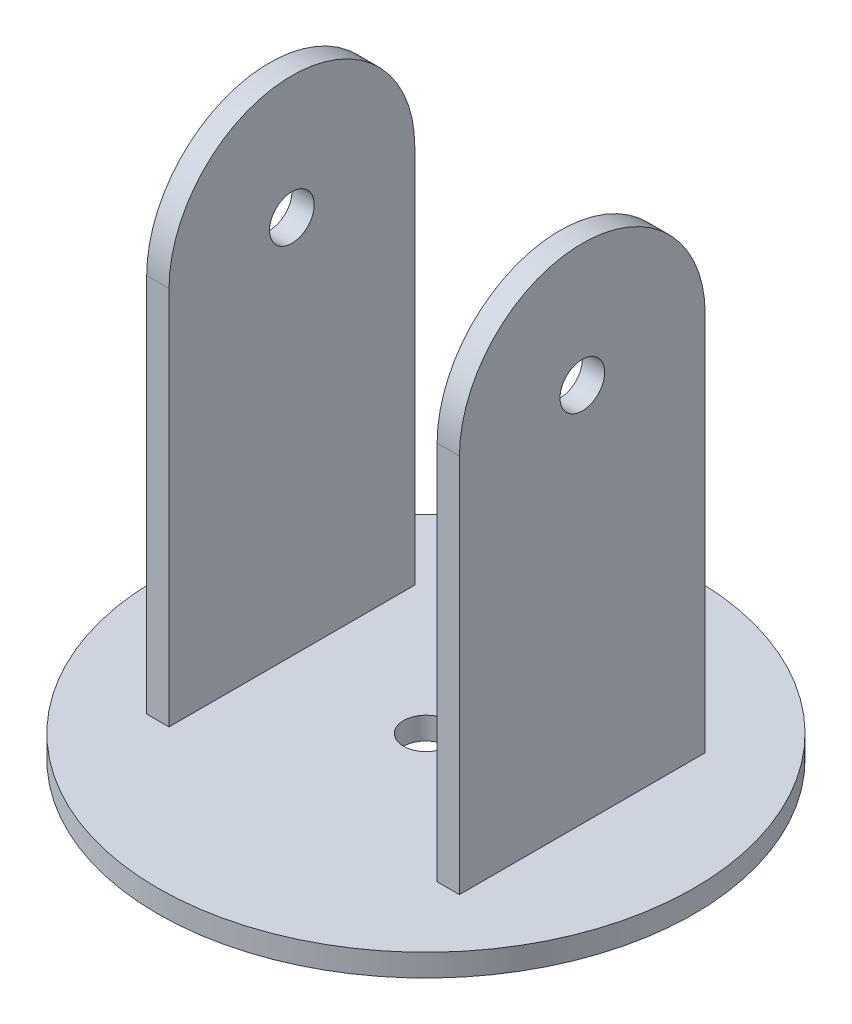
ISO-10303-21;
HEADER;
FILE_DESCRIPTION(('STEP AP214'),'2;1');
FILE_NAME('part.step','',(''),(''),'','','');
FILE_SCHEMA(('AUTOMOTIVE_DESIGN { 1 0 10303 214 1 1 1 1 }'));
ENDSEC;
DATA;
#1=APPLICATION_CONTEXT('core data for automotive mechanical design processes');
#2=APPLICATION_PROTOCOL_DEFINITION('international standard','automotive_design',2000,#1);
#3=PRODUCT_CONTEXT('',#1,'mechanical');
#4=PRODUCT('Part','Part','',(#3));
#5=PRODUCT_RELATED_PRODUCT_CATEGORY('part','',(#4));
#6=PRODUCT_DEFINITION_FORMATION('','',#4);
#7=PRODUCT_DEFINITION_CONTEXT('part definition',#1,'design');
#8=PRODUCT_DEFINITION('design','',#6,#7);
#9=PRODUCT_DEFINITION_SHAPE('','',#8);
#10=(LENGTH_UNIT() NAMED_UNIT(*) SI_UNIT(.MILLI.,.METRE.));
#11=(NAMED_UNIT(*) PLANE_ANGLE_UNIT() SI_UNIT($,.RADIAN.));
#12=(NAMED_UNIT(*) SI_UNIT($,.STERADIAN.) SOLID_ANGLE_UNIT());
#13=UNCERTAINTY_MEASURE_WITH_UNIT(LENGTH_MEASURE(1.E-05),#10,'distance_accuracy_value','');
#14=(GEOMETRIC_REPRESENTATION_CONTEXT(3) GLOBAL_UNCERTAINTY_ASSIGNED_CONTEXT((#13)) GLOBAL_UNIT_ASSIGNED_CONTEXT((#10,
#11,#12)) REPRESENTATION_CONTEXT('',''));
#15=CARTESIAN_POINT('',(0.,0.,0.));
#16=DIRECTION('',(0.,0.,1.));
#17=DIRECTION('',(1.,0.,0.));
#18=AXIS2_PLACEMENT_3D('',#15,#16,#17);
#19=CARTESIAN_POINT('',(0.,5.,0.));
#20=DIRECTION('',(0.,-1.,0.));
#21=DIRECTION('',(0.,0.,-1.));
#22=AXIS2_PLACEMENT_3D('',#19,#20,#21);
#23=CYLINDRICAL_SURFACE('',#22,60.);
#24=CARTESIAN_POINT('',(0.,5.,0.));
#25=DIRECTION('',(0.,1.,0.));
#26=DIRECTION('',(0.,0.,1.));
#27=AXIS2_PLACEMENT_3D('',#24,#25,#26);
#28=CIRCLE('',#27,60.);
#29=CARTESIAN_POINT('',(0.,5.,60.));
#30=VERTEX_POINT('',#29);
#31=EDGE_CURVE('E11',#30,#30,#28,.T.);
#32=ORIENTED_EDGE('',*,*,#31,.F.);
#33=EDGE_LOOP('',(#32));
#34=FACE_BOUND('',#33,.T.);
#35=CARTESIAN_POINT('',(0.,0.,0.));
#36=DIRECTION('',(0.,1.,0.));
#37=DIRECTION('',(0.,0.,1.));
#38=AXIS2_PLACEMENT_3D('',#35,#36,#37);
#39=CIRCLE('',#38,60.);
#40=CARTESIAN_POINT('',(0.,0.,60.));
#41=VERTEX_POINT('',#40);
#42=EDGE_CURVE('E48',#41,#41,#39,.T.);
#43=ORIENTED_EDGE('',*,*,#42,.T.);
#44=EDGE_LOOP('',(#43));
#45=FACE_BOUND('',#44,.T.);
#46=ADVANCED_FACE('F39',(#34,#45),#23,.T.);
#47=CARTESIAN_POINT('',(0.,5.,0.));
#48=DIRECTION('',(0.,1.,0.));
#49=DIRECTION('',(0.,0.,1.));
#50=AXIS2_PLACEMENT_3D('',#47,#48,#49);
#51=PLANE('',#50);
#52=CARTESIAN_POINT('',(0.,5.,0.));
#53=DIRECTION('',(0.,1.,0.));
#54=DIRECTION('',(0.,0.,1.));
#55=AXIS2_PLACEMENT_3D('',#52,#53,#54);
#56=CIRCLE('',#55,5.);
#57=CARTESIAN_POINT('',(0.,5.,5.));
#58=VERTEX_POINT('',#57);
#59=EDGE_CURVE('E384',#58,#58,#56,.T.);
#60=ORIENTED_EDGE('',*,*,#59,.F.);
#61=EDGE_LOOP('',(#60));
#62=FACE_BOUND('',#61,.T.);
#63=DIRECTION('',(0.,0.,-1.));
#64=VECTOR('',#63,1.);
#65=CARTESIAN_POINT('',(-30.,5.,0.));
#66=LINE('',#65,#64);
#67=CARTESIAN_POINT('',(-30.,5.,27.5));
#68=VERTEX_POINT('',#67);
#69=CARTESIAN_POINT('',(-30.,5.,-27.5));
#70=VERTEX_POINT('',#69);
#71=EDGE_CURVE('E115',#68,#70,#66,.T.);
#72=ORIENTED_EDGE('',*,*,#71,.F.);
#73=DIRECTION('',(-1.,0.,0.));
#74=VECTOR('',#73,1.);
#75=CARTESIAN_POINT('',(0.,5.,27.5));
#76=LINE('',#75,#74);
#77=CARTESIAN_POINT('',(-35.,5.,27.5));
#78=VERTEX_POINT('',#77);
#79=EDGE_CURVE('E159',#68,#78,#76,.T.);
#80=ORIENTED_EDGE('',*,*,#79,.T.);
#81=DIRECTION('',(0.,0.,-1.));
#82=VECTOR('',#81,1.);
#83=CARTESIAN_POINT('',(-35.,5.,0.));
#84=LINE('',#83,#82);
#85=CARTESIAN_POINT('',(-35.,5.,-27.5));
#86=VERTEX_POINT('',#85);
#87=EDGE_CURVE('E149',#78,#86,#84,.T.);
#88=ORIENTED_EDGE('',*,*,#87,.T.);
#89=DIRECTION('',(1.,0.,0.));
#90=VECTOR('',#89,1.);
#91=CARTESIAN_POINT('',(0.,5.,-27.5));
#92=LINE('',#91,#90);
#93=EDGE_CURVE('E156',#86,#70,#92,.T.);
#94=ORIENTED_EDGE('',*,*,#93,.T.);
#95=EDGE_LOOP('',(#72,#80,#88,#94));
#96=FACE_BOUND('',#95,.T.);
#97=DIRECTION('',(0.,0.,1.));
#98=VECTOR('',#97,1.);
#99=CARTESIAN_POINT('',(30.,5.,0.));
#100=LINE('',#99,#98);
#101=CARTESIAN_POINT('',(30.,5.,-27.5));
#102=VERTEX_POINT('',#101);
#103=CARTESIAN_POINT('',(30.,5.,27.5));
#104=VERTEX_POINT('',#103);
#105=EDGE_CURVE('E193',#102,#104,#100,.T.);
#106=ORIENTED_EDGE('',*,*,#105,.F.);
#107=DIRECTION('',(-1.,0.,0.));
#108=VECTOR('',#107,1.);
#109=CARTESIAN_POINT('',(0.,5.,-27.5));
#110=LINE('',#109,#108);
#111=CARTESIAN_POINT('',(35.,5.,-27.5));
#112=VERTEX_POINT('',#111);
#113=EDGE_CURVE('E199',#112,#102,#110,.T.);
#114=ORIENTED_EDGE('',*,*,#113,.F.);
#115=DIRECTION('',(0.,0.,1.));
#116=VECTOR('',#115,1.);
#117=CARTESIAN_POINT('',(35.,5.,0.));
#118=LINE('',#117,#116);
#119=CARTESIAN_POINT('',(35.,5.,27.5));
#120=VERTEX_POINT('',#119);
#121=EDGE_CURVE('E187',#112,#120,#118,.T.);
#122=ORIENTED_EDGE('',*,*,#121,.T.);
#123=DIRECTION('',(1.,0.,0.));
#124=VECTOR('',#123,1.);
#125=CARTESIAN_POINT('',(0.,5.,27.5));
#126=LINE('',#125,#124);
#127=EDGE_CURVE('E196',#104,#120,#126,.T.);
#128=ORIENTED_EDGE('',*,*,#127,.F.);
#129=EDGE_LOOP('',(#106,#114,#122,#128));
#130=FACE_BOUND('',#129,.T.);
#131=ORIENTED_EDGE('',*,*,#31,.T.);
#132=EDGE_LOOP('',(#131));
#133=FACE_BOUND('',#132,.T.);
#134=ADVANCED_FACE('F209',(#62,#96,#130,#133),#51,.T.);
#135=CARTESIAN_POINT('',(0.,0.,0.));
#136=DIRECTION('',(0.,1.,0.));
#137=DIRECTION('',(0.,0.,1.));
#138=AXIS2_PLACEMENT_3D('',#135,#136,#137);
#139=PLANE('',#138);
#140=CARTESIAN_POINT('',(0.,0.,0.));
#141=DIRECTION('',(0.,1.,0.));
#142=DIRECTION('',(0.,0.,1.));
#143=AXIS2_PLACEMENT_3D('',#140,#141,#142);
#144=CIRCLE('',#143,5.);
#145=CARTESIAN_POINT('',(0.,0.,5.));
#146=VERTEX_POINT('',#145);
#147=EDGE_CURVE('E383',#146,#146,#144,.T.);
#148=ORIENTED_EDGE('',*,*,#147,.T.);
#149=EDGE_LOOP('',(#148));
#150=FACE_BOUND('',#149,.T.);
#151=ORIENTED_EDGE('',*,*,#42,.F.);
#152=EDGE_LOOP('',(#151));
#153=FACE_BOUND('',#152,.T.);
#154=ADVANCED_FACE('F206',(#150,#153),#139,.F.);
#155=CARTESIAN_POINT('',(30.,90.,0.));
#156=DIRECTION('',(1.,0.,0.));
#157=DIRECTION('',(0.,0.,-1.));
#158=AXIS2_PLACEMENT_3D('',#155,#156,#157);
#159=CYLINDRICAL_SURFACE('',#158,27.5);
#160=CARTESIAN_POINT('',(35.,90.,0.));
#161=DIRECTION('',(1.,0.,0.));
#162=DIRECTION('',(0.,0.,1.));
#163=AXIS2_PLACEMENT_3D('',#160,#161,#162);
#164=CIRCLE('',#163,27.5);
#165=CARTESIAN_POINT('',(35.,90.,-27.5));
#166=VERTEX_POINT('',#165);
#167=CARTESIAN_POINT('',(35.,90.,27.5));
#168=VERTEX_POINT('',#167);
#169=EDGE_CURVE('E163',#166,#168,#164,.T.);
#170=ORIENTED_EDGE('',*,*,#169,.F.);
#171=DIRECTION('',(1.,0.,0.));
#172=VECTOR('',#171,1.);
#173=CARTESIAN_POINT('',(30.,90.,-27.5));
#174=LINE('',#173,#172);
#175=CARTESIAN_POINT('',(30.,90.,-27.5));
#176=VERTEX_POINT('',#175);
#177=EDGE_CURVE('E183',#176,#166,#174,.T.);
#178=ORIENTED_EDGE('',*,*,#177,.F.);
#179=CARTESIAN_POINT('',(30.,90.,0.));
#180=DIRECTION('',(1.,0.,0.));
#181=DIRECTION('',(0.,0.,1.));
#182=AXIS2_PLACEMENT_3D('',#179,#180,#181);
#183=CIRCLE('',#182,27.5);
#184=CARTESIAN_POINT('',(30.,90.,27.5));
#185=VERTEX_POINT('',#184);
#186=EDGE_CURVE('E164',#176,#185,#183,.T.);
#187=ORIENTED_EDGE('',*,*,#186,.T.);
#188=DIRECTION('',(1.,0.,0.));
#189=VECTOR('',#188,1.);
#190=CARTESIAN_POINT('',(30.,90.,27.5));
#191=LINE('',#190,#189);
#192=EDGE_CURVE('E176',#185,#168,#191,.T.);
#193=ORIENTED_EDGE('',*,*,#192,.T.);
#194=EDGE_LOOP('',(#170,#178,#187,#193));
#195=FACE_BOUND('',#194,.T.);
#196=ADVANCED_FACE('F208',(#195),#159,.T.);
#197=CARTESIAN_POINT('',(30.,0.,-27.5));
#198=DIRECTION('',(0.,0.,-1.));
#199=DIRECTION('',(-1.,0.,0.));
#200=AXIS2_PLACEMENT_3D('',#197,#198,#199);
#201=PLANE('',#200);
#202=DIRECTION('',(0.,1.,0.));
#203=VECTOR('',#202,1.);
#204=CARTESIAN_POINT('',(35.,0.,-27.5));
#205=LINE('',#204,#203);
#206=EDGE_CURVE('E169',#112,#166,#205,.T.);
#207=ORIENTED_EDGE('',*,*,#206,.F.);
#208=ORIENTED_EDGE('',*,*,#113,.T.);
#209=DIRECTION('',(0.,1.,0.));
#210=VECTOR('',#209,1.);
#211=CARTESIAN_POINT('',(30.,0.,-27.5));
#212=LINE('',#211,#210);
#213=EDGE_CURVE('E173',#102,#176,#212,.T.);
#214=ORIENTED_EDGE('',*,*,#213,.T.);
#215=ORIENTED_EDGE('',*,*,#177,.T.);
#216=EDGE_LOOP('',(#207,#208,#214,#215));
#217=FACE_BOUND('',#216,.T.);
#218=ADVANCED_FACE('F215',(#217),#201,.T.);
#219=CARTESIAN_POINT('',(30.,0.,27.5));
#220=DIRECTION('',(0.,0.,1.));
#221=DIRECTION('',(1.,0.,0.));
#222=AXIS2_PLACEMENT_3D('',#219,#220,#221);
#223=PLANE('',#222);
#224=DIRECTION('',(0.,-1.,0.));
#225=VECTOR('',#224,1.);
#226=CARTESIAN_POINT('',(30.,0.,27.5));
#227=LINE('',#226,#225);
#228=EDGE_CURVE('E168',#185,#104,#227,.T.);
#229=ORIENTED_EDGE('',*,*,#228,.T.);
#230=ORIENTED_EDGE('',*,*,#127,.T.);
#231=DIRECTION('',(0.,-1.,0.));
#232=VECTOR('',#231,1.);
#233=CARTESIAN_POINT('',(35.,0.,27.5));
#234=LINE('',#233,#232);
#235=EDGE_CURVE('E64',#168,#120,#234,.T.);
#236=ORIENTED_EDGE('',*,*,#235,.F.);
#237=ORIENTED_EDGE('',*,*,#192,.F.);
#238=EDGE_LOOP('',(#229,#230,#236,#237));
#239=FACE_BOUND('',#238,.T.);
#240=ADVANCED_FACE('F315',(#239),#223,.T.);
#241=CARTESIAN_POINT('',(30.,90.,0.));
#242=DIRECTION('',(-1.,0.,0.));
#243=DIRECTION('',(0.,0.,1.));
#244=AXIS2_PLACEMENT_3D('',#241,#242,#243);
#245=PLANE('',#244);
#246=CARTESIAN_POINT('',(30.,90.,0.));
#247=DIRECTION('',(-1.,0.,0.));
#248=DIRECTION('',(0.,0.,1.));
#249=AXIS2_PLACEMENT_3D('',#246,#247,#248);
#250=CIRCLE('',#249,5.);
#251=CARTESIAN_POINT('',(30.,90.,5.));
#252=VERTEX_POINT('',#251);
#253=EDGE_CURVE('E138',#252,#252,#250,.T.);
#254=ORIENTED_EDGE('',*,*,#253,.F.);
#255=EDGE_LOOP('',(#254));
#256=FACE_BOUND('',#255,.T.);
#257=ORIENTED_EDGE('',*,*,#213,.F.);
#258=ORIENTED_EDGE('',*,*,#105,.T.);
#259=ORIENTED_EDGE('',*,*,#228,.F.);
#260=ORIENTED_EDGE('',*,*,#186,.F.);
#261=EDGE_LOOP('',(#257,#258,#259,#260));
#262=FACE_BOUND('',#261,.T.);
#263=ADVANCED_FACE('F308',(#256,#262),#245,.T.);
#264=CARTESIAN_POINT('',(35.,90.,0.));
#265=DIRECTION('',(-1.,0.,0.));
#266=DIRECTION('',(0.,0.,1.));
#267=AXIS2_PLACEMENT_3D('',#264,#265,#266);
#268=PLANE('',#267);
#269=CARTESIAN_POINT('',(35.,90.,0.));
#270=DIRECTION('',(1.,0.,0.));
#271=DIRECTION('',(0.,0.,-1.));
#272=AXIS2_PLACEMENT_3D('',#269,#270,#271);
#273=CIRCLE('',#272,5.);
#274=CARTESIAN_POINT('',(35.,90.,-5.));
#275=VERTEX_POINT('',#274);
#276=EDGE_CURVE('E378',#275,#275,#273,.T.);
#277=ORIENTED_EDGE('',*,*,#276,.F.);
#278=EDGE_LOOP('',(#277));
#279=FACE_BOUND('',#278,.T.);
#280=ORIENTED_EDGE('',*,*,#121,.F.);
#281=ORIENTED_EDGE('',*,*,#206,.T.);
#282=ORIENTED_EDGE('',*,*,#169,.T.);
#283=ORIENTED_EDGE('',*,*,#235,.T.);
#284=EDGE_LOOP('',(#280,#281,#282,#283));
#285=FACE_BOUND('',#284,.T.);
#286=ADVANCED_FACE('F301',(#279,#285),#268,.F.);
#287=CARTESIAN_POINT('',(-30.,90.,0.));
#288=DIRECTION('',(-1.,0.,0.));
#289=DIRECTION('',(0.,0.,1.));
#290=AXIS2_PLACEMENT_3D('',#287,#288,#289);
#291=CYLINDRICAL_SURFACE('',#290,27.5);
#292=CARTESIAN_POINT('',(-35.,90.,0.));
#293=DIRECTION('',(1.,0.,0.));
#294=DIRECTION('',(0.,0.,1.));
#295=AXIS2_PLACEMENT_3D('',#292,#293,#294);
#296=CIRCLE('',#295,27.5);
#297=CARTESIAN_POINT('',(-35.,90.,-27.5));
#298=VERTEX_POINT('',#297);
#299=CARTESIAN_POINT('',(-35.,90.,27.5));
#300=VERTEX_POINT('',#299);
#301=EDGE_CURVE('E143',#298,#300,#296,.T.);
#302=ORIENTED_EDGE('',*,*,#301,.T.);
#303=DIRECTION('',(-1.,0.,0.));
#304=VECTOR('',#303,1.);
#305=CARTESIAN_POINT('',(-30.,90.,27.5));
#306=LINE('',#305,#304);
#307=CARTESIAN_POINT('',(-30.,90.,27.5));
#308=VERTEX_POINT('',#307);
#309=EDGE_CURVE('E127',#308,#300,#306,.T.);
#310=ORIENTED_EDGE('',*,*,#309,.F.);
#311=CARTESIAN_POINT('',(-30.,90.,0.));
#312=DIRECTION('',(1.,0.,0.));
#313=DIRECTION('',(0.,0.,1.));
#314=AXIS2_PLACEMENT_3D('',#311,#312,#313);
#315=CIRCLE('',#314,27.5);
#316=CARTESIAN_POINT('',(-30.,90.,-27.5));
#317=VERTEX_POINT('',#316);
#318=EDGE_CURVE('E112',#317,#308,#315,.T.);
#319=ORIENTED_EDGE('',*,*,#318,.F.);
#320=DIRECTION('',(-1.,0.,0.));
#321=VECTOR('',#320,1.);
#322=CARTESIAN_POINT('',(-30.,90.,-27.5));
#323=LINE('',#322,#321);
#324=EDGE_CURVE('E122',#317,#298,#323,.T.);
#325=ORIENTED_EDGE('',*,*,#324,.T.);
#326=EDGE_LOOP('',(#302,#310,#319,#325));
#327=FACE_BOUND('',#326,.T.);
#328=ADVANCED_FACE('F129',(#327),#291,.T.);
#329=CARTESIAN_POINT('',(-30.,0.,27.5));
#330=DIRECTION('',(0.,0.,-1.));
#331=DIRECTION('',(-1.,0.,0.));
#332=AXIS2_PLACEMENT_3D('',#329,#330,#331);
#333=PLANE('',#332);
#334=ORIENTED_EDGE('',*,*,#79,.F.);
#335=DIRECTION('',(0.,-1.,0.));
#336=VECTOR('',#335,1.);
#337=CARTESIAN_POINT('',(-30.,0.,27.5));
#338=LINE('',#337,#336);
#339=EDGE_CURVE('E119',#308,#68,#338,.T.);
#340=ORIENTED_EDGE('',*,*,#339,.F.);
#341=ORIENTED_EDGE('',*,*,#309,.T.);
#342=DIRECTION('',(0.,-1.,0.));
#343=VECTOR('',#342,1.);
#344=CARTESIAN_POINT('',(-35.,0.,27.5));
#345=LINE('',#344,#343);
#346=EDGE_CURVE('E132',#300,#78,#345,.T.);
#347=ORIENTED_EDGE('',*,*,#346,.T.);
#348=EDGE_LOOP('',(#334,#340,#341,#347));
#349=FACE_BOUND('',#348,.T.);
#350=ADVANCED_FACE('F286',(#349),#333,.F.);
#351=CARTESIAN_POINT('',(-30.,0.,-27.5));
#352=DIRECTION('',(0.,0.,1.));
#353=DIRECTION('',(1.,0.,0.));
#354=AXIS2_PLACEMENT_3D('',#351,#352,#353);
#355=PLANE('',#354);
#356=ORIENTED_EDGE('',*,*,#93,.F.);
#357=DIRECTION('',(0.,1.,0.));
#358=VECTOR('',#357,1.);
#359=CARTESIAN_POINT('',(-35.,0.,-27.5));
#360=LINE('',#359,#358);
#361=EDGE_CURVE('E56',#86,#298,#360,.T.);
#362=ORIENTED_EDGE('',*,*,#361,.T.);
#363=ORIENTED_EDGE('',*,*,#324,.F.);
#364=DIRECTION('',(0.,1.,0.));
#365=VECTOR('',#364,1.);
#366=CARTESIAN_POINT('',(-30.,0.,-27.5));
#367=LINE('',#366,#365);
#368=EDGE_CURVE('E107',#70,#317,#367,.T.);
#369=ORIENTED_EDGE('',*,*,#368,.F.);
#370=EDGE_LOOP('',(#356,#362,#363,#369));
#371=FACE_BOUND('',#370,.T.);
#372=ADVANCED_FACE('F123',(#371),#355,.F.);
#373=CARTESIAN_POINT('',(-30.,90.,0.));
#374=DIRECTION('',(1.,0.,0.));
#375=DIRECTION('',(0.,0.,1.));
#376=AXIS2_PLACEMENT_3D('',#373,#374,#375);
#377=PLANE('',#376);
#378=CARTESIAN_POINT('',(-30.,90.,0.));
#379=DIRECTION('',(1.,0.,0.));
#380=DIRECTION('',(0.,0.,-1.));
#381=AXIS2_PLACEMENT_3D('',#378,#379,#380);
#382=CIRCLE('',#381,5.);
#383=CARTESIAN_POINT('',(-30.,90.,-5.));
#384=VERTEX_POINT('',#383);
#385=EDGE_CURVE('E372',#384,#384,#382,.T.);
#386=ORIENTED_EDGE('',*,*,#385,.F.);
#387=EDGE_LOOP('',(#386));
#388=FACE_BOUND('',#387,.T.);
#389=ORIENTED_EDGE('',*,*,#339,.T.);
#390=ORIENTED_EDGE('',*,*,#71,.T.);
#391=ORIENTED_EDGE('',*,*,#368,.T.);
#392=ORIENTED_EDGE('',*,*,#318,.T.);
#393=EDGE_LOOP('',(#389,#390,#391,#392));
#394=FACE_BOUND('',#393,.T.);
#395=ADVANCED_FACE('F110',(#388,#394),#377,.T.);
#396=CARTESIAN_POINT('',(-35.,90.,0.));
#397=DIRECTION('',(1.,0.,0.));
#398=DIRECTION('',(0.,0.,1.));
#399=AXIS2_PLACEMENT_3D('',#396,#397,#398);
#400=PLANE('',#399);
#401=CARTESIAN_POINT('',(-35.,90.,0.));
#402=DIRECTION('',(1.,0.,0.));
#403=DIRECTION('',(0.,0.,-1.));
#404=AXIS2_PLACEMENT_3D('',#401,#402,#403);
#405=CIRCLE('',#404,5.);
#406=CARTESIAN_POINT('',(-35.,90.,-5.));
#407=VERTEX_POINT('',#406);
#408=EDGE_CURVE('E42',#407,#407,#405,.T.);
#409=ORIENTED_EDGE('',*,*,#408,.T.);
#410=EDGE_LOOP('',(#409));
#411=FACE_BOUND('',#410,.T.);
#412=ORIENTED_EDGE('',*,*,#87,.F.);
#413=ORIENTED_EDGE('',*,*,#346,.F.);
#414=ORIENTED_EDGE('',*,*,#301,.F.);
#415=ORIENTED_EDGE('',*,*,#361,.F.);
#416=EDGE_LOOP('',(#412,#413,#414,#415));
#417=FACE_BOUND('',#416,.T.);
#418=ADVANCED_FACE('F264',(#411,#417),#400,.F.);
#419=CARTESIAN_POINT('',(-60.,90.,0.));
#420=DIRECTION('',(1.,0.,0.));
#421=DIRECTION('',(0.,0.,-1.));
#422=AXIS2_PLACEMENT_3D('',#419,#420,#421);
#423=CYLINDRICAL_SURFACE('',#422,5.);
#424=ORIENTED_EDGE('',*,*,#385,.T.);
#425=EDGE_LOOP('',(#424));
#426=FACE_BOUND('',#425,.T.);
#427=ORIENTED_EDGE('',*,*,#408,.F.);
#428=EDGE_LOOP('',(#427));
#429=FACE_BOUND('',#428,.T.);
#430=ADVANCED_FACE('F259',(#426,#429),#423,.F.);
#431=ORIENTED_EDGE('',*,*,#253,.T.);
#432=EDGE_LOOP('',(#431));
#433=FACE_BOUND('',#432,.T.);
#434=ORIENTED_EDGE('',*,*,#276,.T.);
#435=EDGE_LOOP('',(#434));
#436=FACE_BOUND('',#435,.T.);
#437=ADVANCED_FACE('F238',(#433,#436),#423,.F.);
#438=CARTESIAN_POINT('',(0.,0.,0.));
#439=DIRECTION('',(0.,1.,0.));
#440=DIRECTION('',(0.,0.,1.));
#441=AXIS2_PLACEMENT_3D('',#438,#439,#440);
#442=CYLINDRICAL_SURFACE('',#441,5.);
#443=ORIENTED_EDGE('',*,*,#147,.F.);
#444=EDGE_LOOP('',(#443));
#445=FACE_BOUND('',#444,.T.);
#446=ORIENTED_EDGE('',*,*,#59,.T.);
#447=EDGE_LOOP('',(#446));
#448=FACE_BOUND('',#447,.T.);
#449=ADVANCED_FACE('F248',(#445,#448),#442,.F.);
#450=CLOSED_SHELL('',(#46,#134,#154,#196,#218,#240,#263,#286,#328,#350,#372,#395,#418,#430,#437,#449));
#451=MANIFOLD_SOLID_BREP('B2',#450);
#452=ADVANCED_BREP_SHAPE_REPRESENTATION('',(#18,#451),#14);
#453=SHAPE_DEFINITION_REPRESENTATION(#9,#452);
ENDSEC;
END-ISO-10303-21;
